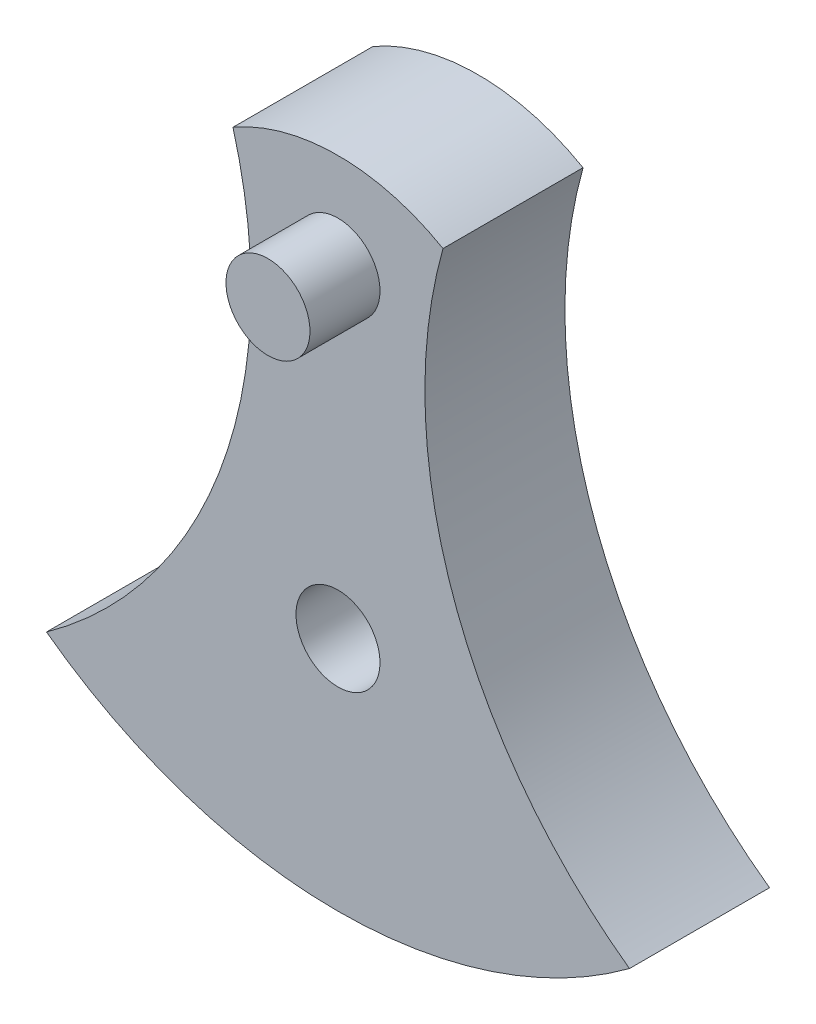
ISO-10303-21;
HEADER;
FILE_DESCRIPTION(('STEP AP214'),'2;1');
FILE_NAME('part.step','',(''),(''),'','','');
FILE_SCHEMA(('AUTOMOTIVE_DESIGN { 1 0 10303 214 1 1 1 1 }'));
ENDSEC;
DATA;
#1=APPLICATION_CONTEXT('core data for automotive mechanical design processes');
#2=APPLICATION_PROTOCOL_DEFINITION('international standard','automotive_design',2000,#1);
#3=PRODUCT_CONTEXT('',#1,'mechanical');
#4=PRODUCT('Part','Part','',(#3));
#5=PRODUCT_RELATED_PRODUCT_CATEGORY('part','',(#4));
#6=PRODUCT_DEFINITION_FORMATION('','',#4);
#7=PRODUCT_DEFINITION_CONTEXT('part definition',#1,'design');
#8=PRODUCT_DEFINITION('design','',#6,#7);
#9=PRODUCT_DEFINITION_SHAPE('','',#8);
#10=(LENGTH_UNIT() NAMED_UNIT(*) SI_UNIT(.MILLI.,.METRE.));
#11=(NAMED_UNIT(*) PLANE_ANGLE_UNIT() SI_UNIT($,.RADIAN.));
#12=(NAMED_UNIT(*) SI_UNIT($,.STERADIAN.) SOLID_ANGLE_UNIT());
#13=UNCERTAINTY_MEASURE_WITH_UNIT(LENGTH_MEASURE(1.E-05),#10,'distance_accuracy_value','');
#14=(GEOMETRIC_REPRESENTATION_CONTEXT(3) GLOBAL_UNCERTAINTY_ASSIGNED_CONTEXT((#13)) GLOBAL_UNIT_ASSIGNED_CONTEXT((#10,
#11,#12)) REPRESENTATION_CONTEXT('',''));
#15=CARTESIAN_POINT('',(0.,0.,0.));
#16=DIRECTION('',(0.,0.,1.));
#17=DIRECTION('',(1.,0.,0.));
#18=AXIS2_PLACEMENT_3D('',#15,#16,#17);
#19=CARTESIAN_POINT('',(0.,0.,5.));
#20=DIRECTION('',(0.,0.,-1.));
#21=DIRECTION('',(-1.,0.,0.));
#22=AXIS2_PLACEMENT_3D('',#19,#20,#21);
#23=CYLINDRICAL_SURFACE('',#22,3.);
#24=CARTESIAN_POINT('',(0.,0.,5.));
#25=DIRECTION('',(0.,0.,1.));
#26=DIRECTION('',(1.,0.,0.));
#27=AXIS2_PLACEMENT_3D('',#24,#25,#26);
#28=CIRCLE('',#27,3.);
#29=CARTESIAN_POINT('',(3.,0.,5.));
#30=VERTEX_POINT('',#29);
#31=EDGE_CURVE('E11',#30,#30,#28,.T.);
#32=ORIENTED_EDGE('',*,*,#31,.F.);
#33=EDGE_LOOP('',(#32));
#34=FACE_BOUND('',#33,.T.);
#35=CARTESIAN_POINT('',(0.,0.,0.));
#36=DIRECTION('',(0.,0.,1.));
#37=DIRECTION('',(1.,0.,0.));
#38=AXIS2_PLACEMENT_3D('',#35,#36,#37);
#39=CIRCLE('',#38,3.);
#40=CARTESIAN_POINT('',(3.,0.,0.));
#41=VERTEX_POINT('',#40);
#42=EDGE_CURVE('E46',#41,#41,#39,.T.);
#43=ORIENTED_EDGE('',*,*,#42,.T.);
#44=EDGE_LOOP('',(#43));
#45=FACE_BOUND('',#44,.T.);
#46=ADVANCED_FACE('F43',(#34,#45),#23,.T.);
#47=CARTESIAN_POINT('',(0.,0.,5.));
#48=DIRECTION('',(0.,0.,1.));
#49=DIRECTION('',(1.,0.,0.));
#50=AXIS2_PLACEMENT_3D('',#47,#48,#49);
#51=PLANE('',#50);
#52=ORIENTED_EDGE('',*,*,#31,.T.);
#53=EDGE_LOOP('',(#52));
#54=FACE_BOUND('',#53,.T.);
#55=ADVANCED_FACE('F58',(#54),#51,.T.);
#56=CARTESIAN_POINT('',(0.,0.,0.));
#57=DIRECTION('',(0.,0.,1.));
#58=DIRECTION('',(1.,0.,0.));
#59=AXIS2_PLACEMENT_3D('',#56,#57,#58);
#60=PLANE('',#59);
#61=ORIENTED_EDGE('',*,*,#42,.F.);
#62=EDGE_LOOP('',(#61));
#63=FACE_BOUND('',#62,.T.);
#64=ADVANCED_FACE('F56',(#63),#60,.F.);
#65=CLOSED_SHELL('',(#46,#55,#64));
#66=MANIFOLD_SOLID_BREP('B2',#65);
#67=CARTESIAN_POINT('',(-41.2063152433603,-4.5587200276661,-10.));
#68=DIRECTION('',(0.,0.,1.));
#69=DIRECTION('',(1.,0.,0.));
#70=AXIS2_PLACEMENT_3D('',#67,#68,#69);
#71=CYLINDRICAL_SURFACE('',#70,35.);
#72=CARTESIAN_POINT('',(-41.2063152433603,-4.5587200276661,0.));
#73=DIRECTION('',(0.,0.,1.));
#74=DIRECTION('',(1.,0.,0.));
#75=AXIS2_PLACEMENT_3D('',#72,#73,#74);
#76=CIRCLE('',#75,35.);
#77=CARTESIAN_POINT('',(-7.50000000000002,4.86912769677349,0.));
#78=VERTEX_POINT('',#77);
#79=CARTESIAN_POINT('',(-20.818797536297,-33.0077819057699,0.));
#80=VERTEX_POINT('',#79);
#81=EDGE_CURVE('E159',#78,#80,#76,.F.);
#82=ORIENTED_EDGE('',*,*,#81,.F.);
#83=DIRECTION('',(0.,0.,1.));
#84=VECTOR('',#83,1.);
#85=CARTESIAN_POINT('',(-7.50000000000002,4.86912769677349,-10.));
#86=LINE('',#85,#84);
#87=CARTESIAN_POINT('',(-7.50000000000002,4.86912769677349,-10.));
#88=VERTEX_POINT('',#87);
#89=EDGE_CURVE('E41',#88,#78,#86,.T.);
#90=ORIENTED_EDGE('',*,*,#89,.F.);
#91=CARTESIAN_POINT('',(-41.2063152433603,-4.5587200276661,-10.));
#92=DIRECTION('',(0.,0.,1.));
#93=DIRECTION('',(1.,0.,0.));
#94=AXIS2_PLACEMENT_3D('',#91,#92,#93);
#95=CIRCLE('',#94,35.);
#96=CARTESIAN_POINT('',(-20.818797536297,-33.0077819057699,-10.));
#97=VERTEX_POINT('',#96);
#98=EDGE_CURVE('E146',#88,#97,#95,.F.);
#99=ORIENTED_EDGE('',*,*,#98,.T.);
#100=DIRECTION('',(0.,0.,1.));
#101=VECTOR('',#100,1.);
#102=CARTESIAN_POINT('',(-20.818797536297,-33.0077819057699,-10.));
#103=LINE('',#102,#101);
#104=EDGE_CURVE('E88',#97,#80,#103,.T.);
#105=ORIENTED_EDGE('',*,*,#104,.T.);
#106=EDGE_LOOP('',(#82,#90,#99,#105));
#107=FACE_BOUND('',#106,.T.);
#108=ADVANCED_FACE('F84',(#107),#71,.F.);
#109=CARTESIAN_POINT('',(0.,-8.12125335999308,-10.));
#110=DIRECTION('',(0.,0.,1.));
#111=DIRECTION('',(1.,0.,0.));
#112=AXIS2_PLACEMENT_3D('',#109,#110,#111);
#113=CYLINDRICAL_SURFACE('',#112,15.);
#114=CARTESIAN_POINT('',(0.,-8.12125335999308,0.));
#115=DIRECTION('',(0.,0.,1.));
#116=DIRECTION('',(1.,0.,0.));
#117=AXIS2_PLACEMENT_3D('',#114,#115,#116);
#118=CIRCLE('',#117,15.);
#119=CARTESIAN_POINT('',(7.50000000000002,4.8691276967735,0.));
#120=VERTEX_POINT('',#119);
#121=EDGE_CURVE('E165',#78,#120,#118,.F.);
#122=ORIENTED_EDGE('',*,*,#121,.T.);
#123=DIRECTION('',(0.,0.,1.));
#124=VECTOR('',#123,1.);
#125=CARTESIAN_POINT('',(7.50000000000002,4.8691276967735,-10.));
#126=LINE('',#125,#124);
#127=CARTESIAN_POINT('',(7.50000000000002,4.8691276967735,-10.));
#128=VERTEX_POINT('',#127);
#129=EDGE_CURVE('E94',#128,#120,#126,.T.);
#130=ORIENTED_EDGE('',*,*,#129,.F.);
#131=CARTESIAN_POINT('',(0.,-8.12125335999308,-10.));
#132=DIRECTION('',(0.,0.,1.));
#133=DIRECTION('',(1.,0.,0.));
#134=AXIS2_PLACEMENT_3D('',#131,#132,#133);
#135=CIRCLE('',#134,15.);
#136=EDGE_CURVE('E139',#88,#128,#135,.F.);
#137=ORIENTED_EDGE('',*,*,#136,.F.);
#138=ORIENTED_EDGE('',*,*,#89,.T.);
#139=EDGE_LOOP('',(#122,#130,#137,#138));
#140=FACE_BOUND('',#139,.T.);
#141=ADVANCED_FACE('F170',(#140),#113,.T.);
#142=CARTESIAN_POINT('',(41.2063152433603,-4.55872002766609,-10.));
#143=DIRECTION('',(0.,0.,1.));
#144=DIRECTION('',(1.,0.,0.));
#145=AXIS2_PLACEMENT_3D('',#142,#143,#144);
#146=CYLINDRICAL_SURFACE('',#145,35.);
#147=CARTESIAN_POINT('',(41.2063152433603,-4.55872002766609,0.));
#148=DIRECTION('',(0.,0.,1.));
#149=DIRECTION('',(1.,0.,0.));
#150=AXIS2_PLACEMENT_3D('',#147,#148,#149);
#151=CIRCLE('',#150,35.);
#152=CARTESIAN_POINT('',(20.818797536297,-33.0077819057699,0.));
#153=VERTEX_POINT('',#152);
#154=EDGE_CURVE('E119',#120,#153,#151,.T.);
#155=ORIENTED_EDGE('',*,*,#154,.T.);
#156=DIRECTION('',(0.,0.,1.));
#157=VECTOR('',#156,1.);
#158=CARTESIAN_POINT('',(20.818797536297,-33.0077819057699,-10.));
#159=LINE('',#158,#157);
#160=CARTESIAN_POINT('',(20.818797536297,-33.0077819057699,-10.));
#161=VERTEX_POINT('',#160);
#162=EDGE_CURVE('E143',#161,#153,#159,.T.);
#163=ORIENTED_EDGE('',*,*,#162,.F.);
#164=CARTESIAN_POINT('',(41.2063152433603,-4.55872002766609,-10.));
#165=DIRECTION('',(0.,0.,1.));
#166=DIRECTION('',(1.,0.,0.));
#167=AXIS2_PLACEMENT_3D('',#164,#165,#166);
#168=CIRCLE('',#167,35.);
#169=EDGE_CURVE('E133',#128,#161,#168,.T.);
#170=ORIENTED_EDGE('',*,*,#169,.F.);
#171=ORIENTED_EDGE('',*,*,#129,.T.);
#172=EDGE_LOOP('',(#155,#163,#170,#171));
#173=FACE_BOUND('',#172,.T.);
#174=ADVANCED_FACE('F144',(#173),#146,.F.);
#175=CARTESIAN_POINT('',(0.,-4.87279178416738,-10.));
#176=DIRECTION('',(0.,0.,1.));
#177=DIRECTION('',(1.,0.,0.));
#178=AXIS2_PLACEMENT_3D('',#175,#176,#177);
#179=CYLINDRICAL_SURFACE('',#178,35.);
#180=CARTESIAN_POINT('',(0.,-4.87279178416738,0.));
#181=DIRECTION('',(0.,0.,1.));
#182=DIRECTION('',(1.,0.,0.));
#183=AXIS2_PLACEMENT_3D('',#180,#181,#182);
#184=CIRCLE('',#183,35.);
#185=EDGE_CURVE('E162',#80,#153,#184,.T.);
#186=ORIENTED_EDGE('',*,*,#185,.F.);
#187=ORIENTED_EDGE('',*,*,#104,.F.);
#188=CARTESIAN_POINT('',(0.,-4.87279178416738,-10.));
#189=DIRECTION('',(0.,0.,1.));
#190=DIRECTION('',(1.,0.,0.));
#191=AXIS2_PLACEMENT_3D('',#188,#189,#190);
#192=CIRCLE('',#191,35.);
#193=EDGE_CURVE('E138',#97,#161,#192,.T.);
#194=ORIENTED_EDGE('',*,*,#193,.T.);
#195=ORIENTED_EDGE('',*,*,#162,.T.);
#196=EDGE_LOOP('',(#186,#187,#194,#195));
#197=FACE_BOUND('',#196,.T.);
#198=ADVANCED_FACE('F145',(#197),#179,.T.);
#199=CARTESIAN_POINT('',(0.,-23.,-10.));
#200=DIRECTION('',(0.,0.,1.));
#201=DIRECTION('',(1.,0.,0.));
#202=AXIS2_PLACEMENT_3D('',#199,#200,#201);
#203=CYLINDRICAL_SURFACE('',#202,3.);
#204=CARTESIAN_POINT('',(0.,-23.,-10.));
#205=DIRECTION('',(0.,0.,1.));
#206=DIRECTION('',(1.,0.,0.));
#207=AXIS2_PLACEMENT_3D('',#204,#205,#206);
#208=CIRCLE('',#207,3.);
#209=CARTESIAN_POINT('',(3.,-23.,-10.));
#210=VERTEX_POINT('',#209);
#211=EDGE_CURVE('E148',#210,#210,#208,.T.);
#212=ORIENTED_EDGE('',*,*,#211,.F.);
#213=EDGE_LOOP('',(#212));
#214=FACE_BOUND('',#213,.T.);
#215=CARTESIAN_POINT('',(0.,-23.,0.));
#216=DIRECTION('',(0.,0.,1.));
#217=DIRECTION('',(1.,0.,0.));
#218=AXIS2_PLACEMENT_3D('',#215,#216,#217);
#219=CIRCLE('',#218,3.);
#220=CARTESIAN_POINT('',(3.,-23.,0.));
#221=VERTEX_POINT('',#220);
#222=EDGE_CURVE('E156',#221,#221,#219,.T.);
#223=ORIENTED_EDGE('',*,*,#222,.T.);
#224=EDGE_LOOP('',(#223));
#225=FACE_BOUND('',#224,.T.);
#226=ADVANCED_FACE('F86',(#214,#225),#203,.F.);
#227=CARTESIAN_POINT('',(0.,0.,-10.));
#228=DIRECTION('',(0.,0.,1.));
#229=DIRECTION('',(1.,0.,0.));
#230=AXIS2_PLACEMENT_3D('',#227,#228,#229);
#231=CYLINDRICAL_SURFACE('',#230,3.);
#232=CARTESIAN_POINT('',(0.,0.,-10.));
#233=DIRECTION('',(0.,0.,1.));
#234=DIRECTION('',(1.,0.,0.));
#235=AXIS2_PLACEMENT_3D('',#232,#233,#234);
#236=CIRCLE('',#235,3.);
#237=CARTESIAN_POINT('',(3.,0.,-10.));
#238=VERTEX_POINT('',#237);
#239=EDGE_CURVE('E153',#238,#238,#236,.T.);
#240=ORIENTED_EDGE('',*,*,#239,.F.);
#241=EDGE_LOOP('',(#240));
#242=FACE_BOUND('',#241,.T.);
#243=CARTESIAN_POINT('',(0.,0.,0.));
#244=DIRECTION('',(0.,0.,1.));
#245=DIRECTION('',(1.,0.,0.));
#246=AXIS2_PLACEMENT_3D('',#243,#244,#245);
#247=CIRCLE('',#246,3.);
#248=CARTESIAN_POINT('',(3.,0.,0.));
#249=VERTEX_POINT('',#248);
#250=EDGE_CURVE('E167',#249,#249,#247,.T.);
#251=ORIENTED_EDGE('',*,*,#250,.T.);
#252=EDGE_LOOP('',(#251));
#253=FACE_BOUND('',#252,.T.);
#254=ADVANCED_FACE('F183',(#242,#253),#231,.F.);
#255=CARTESIAN_POINT('',(0.,0.,-10.));
#256=DIRECTION('',(0.,0.,1.));
#257=DIRECTION('',(1.,0.,0.));
#258=AXIS2_PLACEMENT_3D('',#255,#256,#257);
#259=PLANE('',#258);
#260=ORIENTED_EDGE('',*,*,#211,.T.);
#261=EDGE_LOOP('',(#260));
#262=FACE_BOUND('',#261,.T.);
#263=ORIENTED_EDGE('',*,*,#98,.F.);
#264=ORIENTED_EDGE('',*,*,#136,.T.);
#265=ORIENTED_EDGE('',*,*,#169,.T.);
#266=ORIENTED_EDGE('',*,*,#193,.F.);
#267=EDGE_LOOP('',(#263,#264,#265,#266));
#268=FACE_BOUND('',#267,.T.);
#269=ORIENTED_EDGE('',*,*,#239,.T.);
#270=EDGE_LOOP('',(#269));
#271=FACE_BOUND('',#270,.T.);
#272=ADVANCED_FACE('F136',(#262,#268,#271),#259,.F.);
#273=CARTESIAN_POINT('',(0.,0.,0.));
#274=DIRECTION('',(0.,0.,1.));
#275=DIRECTION('',(1.,0.,0.));
#276=AXIS2_PLACEMENT_3D('',#273,#274,#275);
#277=PLANE('',#276);
#278=ORIENTED_EDGE('',*,*,#222,.F.);
#279=EDGE_LOOP('',(#278));
#280=FACE_BOUND('',#279,.T.);
#281=ORIENTED_EDGE('',*,*,#81,.T.);
#282=ORIENTED_EDGE('',*,*,#185,.T.);
#283=ORIENTED_EDGE('',*,*,#154,.F.);
#284=ORIENTED_EDGE('',*,*,#121,.F.);
#285=EDGE_LOOP('',(#281,#282,#283,#284));
#286=FACE_BOUND('',#285,.T.);
#287=ORIENTED_EDGE('',*,*,#250,.F.);
#288=EDGE_LOOP('',(#287));
#289=FACE_BOUND('',#288,.T.);
#290=ADVANCED_FACE('F171',(#280,#286,#289),#277,.T.);
#291=CLOSED_SHELL('',(#108,#141,#174,#198,#226,#254,#272,#290));
#292=MANIFOLD_SOLID_BREP('B6',#291);
#293=ADVANCED_BREP_SHAPE_REPRESENTATION('',(#18,#66,#292),#14);
#294=SHAPE_DEFINITION_REPRESENTATION(#9,#293);
ENDSEC;
END-ISO-10303-21;
